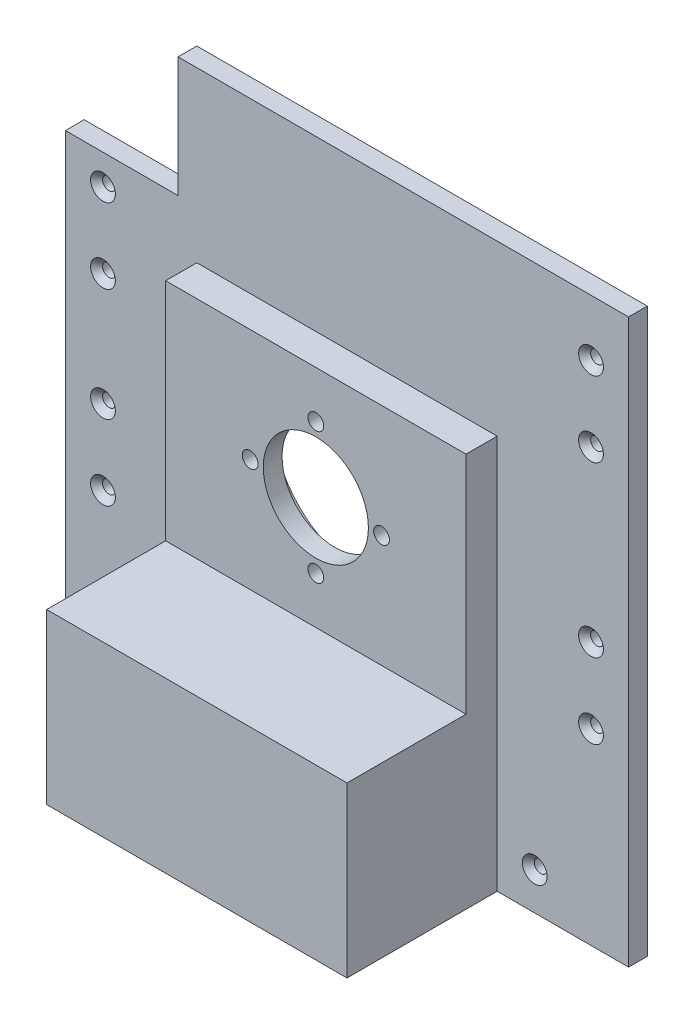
from build123d import *

# Parameters (mm, degrees)
SKETCH_1_W                   = 150
SKETCH_1_H                   = 150
EXTRUDE_1_DEPTH              = 5
SKETCH_2_W                   = 80
SKETCH_2_H                   = 60
EXTRUDE_2_DEPTH              = 8.3
SKETCH_3_W                   = 80
SKETCH_3_H                   = 45
EXTRUDE_3_DEPTH              = 40
SKETCH_4_R                   = 25
CUT_EXTRUDE_1_DEPTH          = 8.3
HOLE_WIZARD_M5_1_D           = 4.2
HOLE_WIZARD_M5_1_DEPTH       = 12.4
HOLE_WIZARD_M5_1_TIP         = 1.2618073
SKETCH_9_R                   = 14
CUT_EXTRUDE_2_DEPTH          = 10
HOLE_WIZARD_M3_1_D           = 3.4
HOLE_WIZARD_M3_1_DEPTH       = 11.5
HOLE_WIZARD_M3_1_CSINK_D     = 6.6
HOLE_WIZARD_M3_1_CSINK_ANGLE = 90
HOLE_WIZARD_M3_1_TIP         = 1.021463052
HOLE_WIZARD_M3_2_D           = 3.4
HOLE_WIZARD_M3_2_DEPTH       = 11.5
HOLE_WIZARD_M3_2_CSINK_D     = 6.6
HOLE_WIZARD_M3_2_CSINK_ANGLE = 90
HOLE_WIZARD_M3_2_TIP         = 1.021463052
HOLE_WIZARD_M3_3_D           = 3.4
HOLE_WIZARD_M3_3_DEPTH       = 11.5
HOLE_WIZARD_M3_3_CSINK_D     = 6.6
HOLE_WIZARD_M3_3_CSINK_ANGLE = 90
HOLE_WIZARD_M3_3_TIP         = 1.021463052
HOLE_WIZARD_M3_4_D           = 3.4
HOLE_WIZARD_M3_4_DEPTH       = 11.5
HOLE_WIZARD_M3_4_CSINK_D     = 6.6
HOLE_WIZARD_M3_4_CSINK_ANGLE = 90
HOLE_WIZARD_M3_4_TIP         = 1.021463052
SKETCH_18_W                  = 30
SKETCH_18_H                  = 32
CUT_EXTRUDE_3_DEPTH          = 114.357840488


with BuildPart() as part:
    # Sketch 1 → Extrude 1 (new body)
    with BuildSketch(Plane.XY):
        Rectangle(SKETCH_1_W, SKETCH_1_H)
    extrude(amount=EXTRUDE_1_DEPTH)

    # Sketch 2 → Extrude 2 (add)
    with BuildSketch(Plane.XY.offset(5)):
        Rectangle(SKETCH_2_W, SKETCH_2_H)
    extrude(amount=EXTRUDE_2_DEPTH)

    # Sketch 3 → Extrude 3 (add)
    with BuildSketch(Plane.XY.offset(5)):
        with Locations((0, -52.5)):
            Rectangle(SKETCH_3_W, SKETCH_3_H)
    extrude(amount=EXTRUDE_3_DEPTH)

    # Sketch 4 → Cut-Extrude 1 (cut)
    with BuildSketch(Plane(origin=(0, 0, 0), x_dir=(-1, 0, 0), z_dir=(0, 0, -1))):
        Circle(SKETCH_4_R)
    extrude(amount=-CUT_EXTRUDE_1_DEPTH, mode=Mode.SUBTRACT)

    # Hole Wizard M5 _1
    with Locations(Plane(origin=(0, 0, 8.3), x_dir=(-1, 0, 0), z_dir=(0, 0, -1))):
        with Locations((0, 17.5), (-17.5, 0), (0, -17.5), (17.5, 0)):
            Hole(HOLE_WIZARD_M5_1_D / 2, depth=HOLE_WIZARD_M5_1_DEPTH)
            with Locations((0, 0, -(HOLE_WIZARD_M5_1_DEPTH + HOLE_WIZARD_M5_1_TIP / 2))):  # 118° drill point
                Cone(0, HOLE_WIZARD_M5_1_D / 2, HOLE_WIZARD_M5_1_TIP, mode=Mode.SUBTRACT)

    # Sketch 9 → Cut-Extrude 2 (cut)
    with BuildSketch(Plane(origin=(0, 0, 8.3), x_dir=(-1, 0, 0), z_dir=(0, 0, -1))):
        Circle(SKETCH_9_R)
    extrude(amount=-CUT_EXTRUDE_2_DEPTH, mode=Mode.SUBTRACT)

    # Hole Wizard M3 _1
    with Locations(Plane.XY.offset(5)):
        with Locations((-65, 35), (-65, 15), (-65, -15), (-65, -35)):
            CounterSinkHole(HOLE_WIZARD_M3_1_D / 2, HOLE_WIZARD_M3_1_CSINK_D / 2, depth=HOLE_WIZARD_M3_1_DEPTH, counter_sink_angle=HOLE_WIZARD_M3_1_CSINK_ANGLE)
            with Locations((0, 0, -(HOLE_WIZARD_M3_1_DEPTH + HOLE_WIZARD_M3_1_TIP / 2))):  # 118° drill point
                Cone(0, HOLE_WIZARD_M3_1_D / 2, HOLE_WIZARD_M3_1_TIP, mode=Mode.SUBTRACT)

    # Hole Wizard M3 _2
    with Locations(Plane.XY.offset(5)):
        with Locations((65, 60), (65, 40), (65, -5), (65, -25)):
            CounterSinkHole(HOLE_WIZARD_M3_2_D / 2, HOLE_WIZARD_M3_2_CSINK_D / 2, depth=HOLE_WIZARD_M3_2_DEPTH, counter_sink_angle=HOLE_WIZARD_M3_2_CSINK_ANGLE)
            with Locations((0, 0, -(HOLE_WIZARD_M3_2_DEPTH + HOLE_WIZARD_M3_2_TIP / 2))):  # 118° drill point
                Cone(0, HOLE_WIZARD_M3_2_D / 2, HOLE_WIZARD_M3_2_TIP, mode=Mode.SUBTRACT)

    # Hole Wizard M3 _3
    with Locations(Plane.XY.offset(5)):
        with Locations((50, -65)):
            CounterSinkHole(HOLE_WIZARD_M3_3_D / 2, HOLE_WIZARD_M3_3_CSINK_D / 2, depth=HOLE_WIZARD_M3_3_DEPTH, counter_sink_angle=HOLE_WIZARD_M3_3_CSINK_ANGLE)
            with Locations((0, 0, -(HOLE_WIZARD_M3_3_DEPTH + HOLE_WIZARD_M3_3_TIP / 2))):  # 118° drill point
                Cone(0, HOLE_WIZARD_M3_3_D / 2, HOLE_WIZARD_M3_3_TIP, mode=Mode.SUBTRACT)

    # Hole Wizard M3 _4
    with Locations(Plane.XY.offset(5)):
        with Locations((-65, -65)):
            CounterSinkHole(HOLE_WIZARD_M3_4_D / 2, HOLE_WIZARD_M3_4_CSINK_D / 2, depth=HOLE_WIZARD_M3_4_DEPTH, counter_sink_angle=HOLE_WIZARD_M3_4_CSINK_ANGLE)
            with Locations((0, 0, -(HOLE_WIZARD_M3_4_DEPTH + HOLE_WIZARD_M3_4_TIP / 2))):  # 118° drill point
                Cone(0, HOLE_WIZARD_M3_4_D / 2, HOLE_WIZARD_M3_4_TIP, mode=Mode.SUBTRACT)

    # Sketch 18 → Cut-Extrude 3 (cut, through all)
    with BuildSketch(Plane.XY.offset(5)):
        with Locations((-60, 59)):
            Rectangle(SKETCH_18_W, SKETCH_18_H)
    extrude(amount=-CUT_EXTRUDE_3_DEPTH, mode=Mode.SUBTRACT)


solid = part.part
